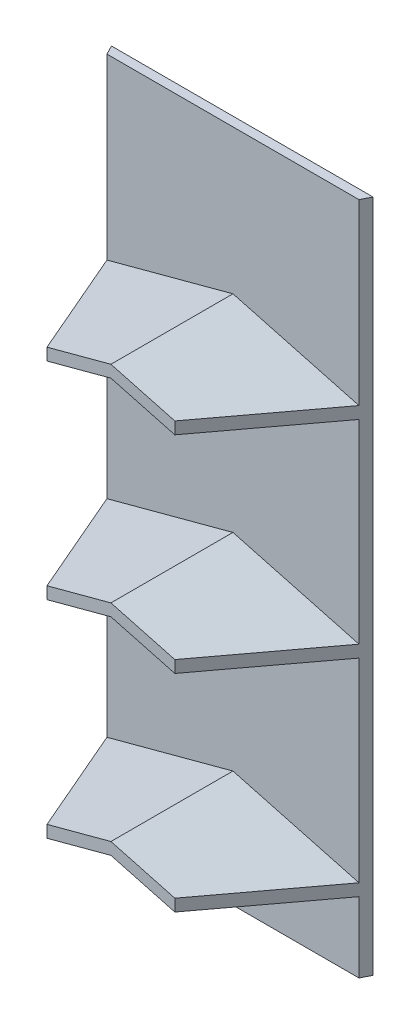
ISO-10303-21;
HEADER;
FILE_DESCRIPTION(('STEP AP214'),'2;1');
FILE_NAME('part.step','',(''),(''),'','','');
FILE_SCHEMA(('AUTOMOTIVE_DESIGN { 1 0 10303 214 1 1 1 1 }'));
ENDSEC;
DATA;
#1=APPLICATION_CONTEXT('core data for automotive mechanical design processes');
#2=APPLICATION_PROTOCOL_DEFINITION('international standard','automotive_design',2000,#1);
#3=PRODUCT_CONTEXT('',#1,'mechanical');
#4=PRODUCT('Part','Part','',(#3));
#5=PRODUCT_RELATED_PRODUCT_CATEGORY('part','',(#4));
#6=PRODUCT_DEFINITION_FORMATION('','',#4);
#7=PRODUCT_DEFINITION_CONTEXT('part definition',#1,'design');
#8=PRODUCT_DEFINITION('design','',#6,#7);
#9=PRODUCT_DEFINITION_SHAPE('','',#8);
#10=(LENGTH_UNIT() NAMED_UNIT(*) SI_UNIT(.MILLI.,.METRE.));
#11=(NAMED_UNIT(*) PLANE_ANGLE_UNIT() SI_UNIT($,.RADIAN.));
#12=(NAMED_UNIT(*) SI_UNIT($,.STERADIAN.) SOLID_ANGLE_UNIT());
#13=UNCERTAINTY_MEASURE_WITH_UNIT(LENGTH_MEASURE(1.E-05),#10,'distance_accuracy_value','');
#14=(GEOMETRIC_REPRESENTATION_CONTEXT(3) GLOBAL_UNCERTAINTY_ASSIGNED_CONTEXT((#13)) GLOBAL_UNIT_ASSIGNED_CONTEXT((#10,
#11,#12)) REPRESENTATION_CONTEXT('',''));
#15=CARTESIAN_POINT('',(0.,0.,0.));
#16=DIRECTION('',(0.,0.,1.));
#17=DIRECTION('',(1.,0.,0.));
#18=AXIS2_PLACEMENT_3D('',#15,#16,#17);
#19=CARTESIAN_POINT('',(0.00200171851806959,17.9147336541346,26.6));
#20=DIRECTION('',(0.258819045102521,0.965925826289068,0.));
#21=DIRECTION('',(-0.965925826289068,0.258819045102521,0.));
#22=AXIS2_PLACEMENT_3D('',#19,#20,#21);
#23=PLANE('',#22);
#24=DIRECTION('',(0.965925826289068,-0.258819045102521,0.));
#25=VECTOR('',#24,1.);
#26=CARTESIAN_POINT('',(0.00200171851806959,17.9147336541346,1.6));
#27=LINE('',#26,#25);
#28=CARTESIAN_POINT('',(0.00200171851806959,17.9147336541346,1.6));
#29=VERTEX_POINT('',#28);
#30=CARTESIAN_POINT('',(21.6858407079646,12.1045665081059,1.6));
#31=VERTEX_POINT('',#30);
#32=EDGE_CURVE('E271',#29,#31,#27,.T.);
#33=ORIENTED_EDGE('',*,*,#32,.T.);
#34=DIRECTION('',(-0.450200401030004,0.120630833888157,0.884741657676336));
#35=VECTOR('',#34,1.);
#36=CARTESIAN_POINT('',(7.01763645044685,16.0348999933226,30.4262101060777));
#37=LINE('',#36,#35);
#38=CARTESIAN_POINT('',(10.9999999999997,14.9678288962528,22.6));
#39=VERTEX_POINT('',#38);
#40=EDGE_CURVE('E328',#31,#39,#37,.T.);
#41=ORIENTED_EDGE('',*,*,#40,.T.);
#42=DIRECTION('',(-0.965925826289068,0.258819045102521,0.));
#43=VECTOR('',#42,1.);
#44=CARTESIAN_POINT('',(0.00200171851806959,17.9147336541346,22.6));
#45=LINE('',#44,#43);
#46=CARTESIAN_POINT('',(0.00200171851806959,17.9147336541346,22.6));
#47=VERTEX_POINT('',#46);
#48=EDGE_CURVE('E383',#39,#47,#45,.T.);
#49=ORIENTED_EDGE('',*,*,#48,.T.);
#50=DIRECTION('',(0.,0.,-1.));
#51=VECTOR('',#50,1.);
#52=CARTESIAN_POINT('',(0.00200171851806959,17.9147336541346,26.6));
#53=LINE('',#52,#51);
#54=EDGE_CURVE('E215',#47,#29,#53,.T.);
#55=ORIENTED_EDGE('',*,*,#54,.T.);
#56=EDGE_LOOP('',(#33,#41,#49,#55));
#57=FACE_BOUND('',#56,.T.);
#58=ADVANCED_FACE('F34',(#57),#23,.F.);
#59=CARTESIAN_POINT('',(0.00200171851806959,17.9147336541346,26.6));
#60=DIRECTION('',(-0.258794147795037,0.965932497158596,0.));
#61=DIRECTION('',(-0.965932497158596,-0.258794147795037,0.));
#62=AXIS2_PLACEMENT_3D('',#59,#60,#61);
#63=PLANE('',#62);
#64=DIRECTION('',(-0.965932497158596,-0.258794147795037,0.));
#65=VECTOR('',#64,1.);
#66=CARTESIAN_POINT('',(0.00200171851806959,17.9147336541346,22.6));
#67=LINE('',#66,#65);
#68=CARTESIAN_POINT('',(-11.0000000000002,14.967060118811,22.6));
#69=VERTEX_POINT('',#68);
#70=EDGE_CURVE('E386',#47,#69,#67,.T.);
#71=ORIENTED_EDGE('',*,*,#70,.T.);
#72=DIRECTION('',(-0.450201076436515,-0.1206185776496,-0.88474298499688));
#73=VECTOR('',#72,1.);
#74=CARTESIAN_POINT('',(-7.01678783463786,16.0342485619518,30.4278778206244));
#75=LINE('',#74,#73);
#76=CARTESIAN_POINT('',(-21.685840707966,12.1040929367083,1.6));
#77=VERTEX_POINT('',#76);
#78=EDGE_CURVE('E289',#69,#77,#75,.T.);
#79=ORIENTED_EDGE('',*,*,#78,.T.);
#80=DIRECTION('',(0.965932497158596,0.258794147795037,0.));
#81=VECTOR('',#80,1.);
#82=CARTESIAN_POINT('',(0.00200171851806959,17.9147336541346,1.6));
#83=LINE('',#82,#81);
#84=EDGE_CURVE('E272',#77,#29,#83,.T.);
#85=ORIENTED_EDGE('',*,*,#84,.T.);
#86=ORIENTED_EDGE('',*,*,#54,.F.);
#87=EDGE_LOOP('',(#71,#79,#85,#86));
#88=FACE_BOUND('',#87,.T.);
#89=ADVANCED_FACE('F390',(#88),#63,.F.);
#90=CARTESIAN_POINT('',(0.,0.,0.));
#91=DIRECTION('',(0.,0.,-1.));
#92=DIRECTION('',(-1.,0.,0.));
#93=AXIS2_PLACEMENT_3D('',#90,#91,#92);
#94=PLANE('',#93);
#95=DIRECTION('',(0.,-1.,0.));
#96=VECTOR('',#95,1.);
#97=CARTESIAN_POINT('',(22.5,115.985822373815,0.));
#98=LINE('',#97,#96);
#99=CARTESIAN_POINT('',(22.5,115.985822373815,0.));
#100=VERTEX_POINT('',#99);
#101=CARTESIAN_POINT('',(22.5,-0.0141776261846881,0.));
#102=VERTEX_POINT('',#101);
#103=EDGE_CURVE('E187',#100,#102,#98,.T.);
#104=ORIENTED_EDGE('',*,*,#103,.T.);
#105=DIRECTION('',(1.,0.,0.));
#106=VECTOR('',#105,1.);
#107=CARTESIAN_POINT('',(-28.575,-0.0141776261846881,0.));
#108=LINE('',#107,#106);
#109=CARTESIAN_POINT('',(-22.5000000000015,-0.0141776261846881,0.));
#110=VERTEX_POINT('',#109);
#111=EDGE_CURVE('E202',#110,#102,#108,.T.);
#112=ORIENTED_EDGE('',*,*,#111,.F.);
#113=DIRECTION('',(0.,-1.,0.));
#114=VECTOR('',#113,1.);
#115=CARTESIAN_POINT('',(-22.5000000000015,115.985822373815,0.));
#116=LINE('',#115,#114);
#117=CARTESIAN_POINT('',(-22.5000000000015,115.985822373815,0.));
#118=VERTEX_POINT('',#117);
#119=EDGE_CURVE('E206',#118,#110,#116,.T.);
#120=ORIENTED_EDGE('',*,*,#119,.F.);
#121=DIRECTION('',(-1.,0.,0.));
#122=VECTOR('',#121,1.);
#123=CARTESIAN_POINT('',(-28.575,115.985822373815,0.));
#124=LINE('',#123,#122);
#125=EDGE_CURVE('E204',#100,#118,#124,.T.);
#126=ORIENTED_EDGE('',*,*,#125,.F.);
#127=EDGE_LOOP('',(#104,#112,#120,#126));
#128=FACE_BOUND('',#127,.T.);
#129=ADVANCED_FACE('F200',(#128),#94,.T.);
#130=CARTESIAN_POINT('',(-28.575,-0.0141776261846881,1.6));
#131=DIRECTION('',(0.,1.,0.));
#132=DIRECTION('',(0.,0.,1.));
#133=AXIS2_PLACEMENT_3D('',#130,#131,#132);
#134=PLANE('',#133);
#135=ORIENTED_EDGE('',*,*,#111,.T.);
#136=DIRECTION('',(0.453512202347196,0.,-0.891250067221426));
#137=VECTOR('',#136,1.);
#138=CARTESIAN_POINT('',(22.5,-0.0141776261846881,0.));
#139=LINE('',#138,#137);
#140=CARTESIAN_POINT('',(21.6858407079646,-0.0141776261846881,1.6));
#141=VERTEX_POINT('',#140);
#142=EDGE_CURVE('E184',#141,#102,#139,.T.);
#143=ORIENTED_EDGE('',*,*,#142,.F.);
#144=DIRECTION('',(1.,0.,0.));
#145=VECTOR('',#144,1.);
#146=CARTESIAN_POINT('',(-28.575,-0.0141776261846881,1.6));
#147=LINE('',#146,#145);
#148=CARTESIAN_POINT('',(-21.685840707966,-0.0141776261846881,1.6));
#149=VERTEX_POINT('',#148);
#150=EDGE_CURVE('E213',#149,#141,#147,.T.);
#151=ORIENTED_EDGE('',*,*,#150,.F.);
#152=DIRECTION('',(0.453512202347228,0.,0.89125006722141));
#153=VECTOR('',#152,1.);
#154=CARTESIAN_POINT('',(-22.5000000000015,-0.0141776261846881,0.));
#155=LINE('',#154,#153);
#156=EDGE_CURVE('E195',#110,#149,#155,.T.);
#157=ORIENTED_EDGE('',*,*,#156,.F.);
#158=EDGE_LOOP('',(#135,#143,#151,#157));
#159=FACE_BOUND('',#158,.T.);
#160=ADVANCED_FACE('F209',(#159),#134,.F.);
#161=CARTESIAN_POINT('',(-28.575,115.985822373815,1.6));
#162=DIRECTION('',(0.,-1.,0.));
#163=DIRECTION('',(0.,0.,-1.));
#164=AXIS2_PLACEMENT_3D('',#161,#162,#163);
#165=PLANE('',#164);
#166=DIRECTION('',(-1.,0.,0.));
#167=VECTOR('',#166,1.);
#168=CARTESIAN_POINT('',(-28.575,115.985822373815,1.6));
#169=LINE('',#168,#167);
#170=CARTESIAN_POINT('',(21.6858407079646,115.985822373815,1.6));
#171=VERTEX_POINT('',#170);
#172=CARTESIAN_POINT('',(-21.685840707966,115.985822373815,1.6));
#173=VERTEX_POINT('',#172);
#174=EDGE_CURVE('E210',#171,#173,#169,.T.);
#175=ORIENTED_EDGE('',*,*,#174,.F.);
#176=DIRECTION('',(0.453512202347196,0.,-0.891250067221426));
#177=VECTOR('',#176,1.);
#178=CARTESIAN_POINT('',(22.5,115.985822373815,0.));
#179=LINE('',#178,#177);
#180=EDGE_CURVE('E402',#171,#100,#179,.T.);
#181=ORIENTED_EDGE('',*,*,#180,.T.);
#182=ORIENTED_EDGE('',*,*,#125,.T.);
#183=DIRECTION('',(0.453512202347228,0.,0.89125006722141));
#184=VECTOR('',#183,1.);
#185=CARTESIAN_POINT('',(-22.5000000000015,115.985822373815,0.));
#186=LINE('',#185,#184);
#187=EDGE_CURVE('E398',#118,#173,#186,.T.);
#188=ORIENTED_EDGE('',*,*,#187,.T.);
#189=EDGE_LOOP('',(#175,#181,#182,#188));
#190=FACE_BOUND('',#189,.T.);
#191=ADVANCED_FACE('F36',(#190),#165,.F.);
#192=CARTESIAN_POINT('',(0.,0.,1.6));
#193=DIRECTION('',(0.,0.,-1.));
#194=DIRECTION('',(-1.,0.,0.));
#195=AXIS2_PLACEMENT_3D('',#192,#193,#194);
#196=PLANE('',#195);
#197=ORIENTED_EDGE('',*,*,#150,.T.);
#198=DIRECTION('',(0.,1.,0.));
#199=VECTOR('',#198,1.);
#200=CARTESIAN_POINT('',(21.6858407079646,0.,1.6));
#201=LINE('',#200,#199);
#202=EDGE_CURVE('E190',#141,#31,#201,.T.);
#203=ORIENTED_EDGE('',*,*,#202,.T.);
#204=ORIENTED_EDGE('',*,*,#32,.F.);
#205=ORIENTED_EDGE('',*,*,#84,.F.);
#206=DIRECTION('',(0.,-1.,0.));
#207=VECTOR('',#206,1.);
#208=CARTESIAN_POINT('',(-21.685840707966,0.,1.6));
#209=LINE('',#208,#207);
#210=EDGE_CURVE('E286',#77,#149,#209,.T.);
#211=ORIENTED_EDGE('',*,*,#210,.T.);
#212=EDGE_LOOP('',(#197,#203,#204,#205,#211));
#213=FACE_BOUND('',#212,.T.);
#214=ADVANCED_FACE('F283',(#213),#196,.F.);
#215=CARTESIAN_POINT('',(-7.59873433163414E-13,91.1058223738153,26.6));
#216=DIRECTION('',(-0.258819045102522,-0.965925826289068,0.));
#217=DIRECTION('',(0.965925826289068,-0.258819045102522,0.));
#218=AXIS2_PLACEMENT_3D('',#215,#216,#217);
#219=PLANE('',#218);
#220=DIRECTION('',(0.965925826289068,-0.258819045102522,0.));
#221=VECTOR('',#220,1.);
#222=CARTESIAN_POINT('',(-7.59873433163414E-13,91.1058223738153,22.6));
#223=LINE('',#222,#221);
#224=CARTESIAN_POINT('',(-7.59873433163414E-13,91.1058223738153,22.6));
#225=VERTEX_POINT('',#224);
#226=CARTESIAN_POINT('',(10.9999999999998,88.1583812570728,22.6));
#227=VERTEX_POINT('',#226);
#228=EDGE_CURVE('E219',#225,#227,#223,.T.);
#229=ORIENTED_EDGE('',*,*,#228,.T.);
#230=DIRECTION('',(0.450200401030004,-0.120630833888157,-0.884741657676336));
#231=VECTOR('',#230,1.);
#232=CARTESIAN_POINT('',(7.01720161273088,89.2255688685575,30.4270646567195));
#233=LINE('',#232,#231);
#234=CARTESIAN_POINT('',(21.6858407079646,85.295118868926,1.6));
#235=VERTEX_POINT('',#234);
#236=EDGE_CURVE('E42',#227,#235,#233,.T.);
#237=ORIENTED_EDGE('',*,*,#236,.T.);
#238=DIRECTION('',(-0.965925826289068,0.258819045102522,0.));
#239=VECTOR('',#238,1.);
#240=CARTESIAN_POINT('',(-7.59873433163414E-13,91.1058223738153,1.6));
#241=LINE('',#240,#239);
#242=CARTESIAN_POINT('',(-7.63278329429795E-13,91.1058223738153,1.6));
#243=VERTEX_POINT('',#242);
#244=EDGE_CURVE('E229',#235,#243,#241,.T.);
#245=ORIENTED_EDGE('',*,*,#244,.T.);
#246=DIRECTION('',(0.,0.,-1.));
#247=VECTOR('',#246,1.);
#248=CARTESIAN_POINT('',(-7.59873433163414E-13,91.1058223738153,26.6));
#249=LINE('',#248,#247);
#250=EDGE_CURVE('E240',#225,#243,#249,.T.);
#251=ORIENTED_EDGE('',*,*,#250,.F.);
#252=EDGE_LOOP('',(#229,#237,#245,#251));
#253=FACE_BOUND('',#252,.T.);
#254=ADVANCED_FACE('F227',(#253),#219,.F.);
#255=CARTESIAN_POINT('',(-7.59873433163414E-13,91.1058223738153,26.6));
#256=DIRECTION('',(0.258819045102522,-0.965925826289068,0.));
#257=DIRECTION('',(0.965925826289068,0.258819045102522,0.));
#258=AXIS2_PLACEMENT_3D('',#255,#256,#257);
#259=PLANE('',#258);
#260=DIRECTION('',(-0.965925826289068,-0.258819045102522,0.));
#261=VECTOR('',#260,1.);
#262=CARTESIAN_POINT('',(-7.59873433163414E-13,91.1058223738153,1.6));
#263=LINE('',#262,#261);
#264=CARTESIAN_POINT('',(-21.685840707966,85.295118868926,1.6));
#265=VERTEX_POINT('',#264);
#266=EDGE_CURVE('E239',#243,#265,#263,.T.);
#267=ORIENTED_EDGE('',*,*,#266,.T.);
#268=DIRECTION('',(0.450200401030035,0.120630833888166,0.884741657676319));
#269=VECTOR('',#268,1.);
#270=CARTESIAN_POINT('',(-7.01720161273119,89.2255688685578,30.4270646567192));
#271=LINE('',#270,#269);
#272=CARTESIAN_POINT('',(-11.0000000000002,88.1583812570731,22.6));
#273=VERTEX_POINT('',#272);
#274=EDGE_CURVE('E337',#265,#273,#271,.T.);
#275=ORIENTED_EDGE('',*,*,#274,.T.);
#276=DIRECTION('',(0.965925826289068,0.258819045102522,0.));
#277=VECTOR('',#276,1.);
#278=CARTESIAN_POINT('',(-7.59873433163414E-13,91.1058223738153,22.6));
#279=LINE('',#278,#277);
#280=EDGE_CURVE('E205',#273,#225,#279,.T.);
#281=ORIENTED_EDGE('',*,*,#280,.T.);
#282=ORIENTED_EDGE('',*,*,#250,.T.);
#283=EDGE_LOOP('',(#267,#275,#281,#282));
#284=FACE_BOUND('',#283,.T.);
#285=ADVANCED_FACE('F422',(#284),#259,.F.);
#286=ORIENTED_EDGE('',*,*,#244,.F.);
#287=DIRECTION('',(0.,1.,0.));
#288=VECTOR('',#287,1.);
#289=CARTESIAN_POINT('',(21.6858407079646,0.,1.6));
#290=LINE('',#289,#288);
#291=EDGE_CURVE('E235',#235,#171,#290,.T.);
#292=ORIENTED_EDGE('',*,*,#291,.T.);
#293=ORIENTED_EDGE('',*,*,#174,.T.);
#294=DIRECTION('',(0.,-1.,0.));
#295=VECTOR('',#294,1.);
#296=CARTESIAN_POINT('',(-21.685840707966,0.,1.6));
#297=LINE('',#296,#295);
#298=EDGE_CURVE('E340',#173,#265,#297,.T.);
#299=ORIENTED_EDGE('',*,*,#298,.T.);
#300=ORIENTED_EDGE('',*,*,#266,.F.);
#301=EDGE_LOOP('',(#286,#292,#293,#299,#300));
#302=FACE_BOUND('',#301,.T.);
#303=ADVANCED_FACE('F234',(#302),#196,.F.);
#304=CARTESIAN_POINT('',(-22.5000000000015,115.985822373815,0.));
#305=DIRECTION('',(0.89125006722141,0.,-0.453512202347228));
#306=DIRECTION('',(-0.453512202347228,0.,-0.89125006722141));
#307=AXIS2_PLACEMENT_3D('',#304,#305,#306);
#308=PLANE('',#307);
#309=ORIENTED_EDGE('',*,*,#78,.F.);
#310=DIRECTION('',(0.,-1.,0.));
#311=VECTOR('',#310,1.);
#312=CARTESIAN_POINT('',(-11.0000000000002,115.985822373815,22.6));
#313=LINE('',#312,#311);
#314=CARTESIAN_POINT('',(-11.0000000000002,17.0383812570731,22.6));
#315=VERTEX_POINT('',#314);
#316=EDGE_CURVE('E357',#315,#69,#313,.T.);
#317=ORIENTED_EDGE('',*,*,#316,.F.);
#318=DIRECTION('',(0.450200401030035,0.120630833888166,0.884741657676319));
#319=VECTOR('',#318,1.);
#320=CARTESIAN_POINT('',(-7.01720161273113,18.1055688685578,30.4270646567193));
#321=LINE('',#320,#319);
#322=CARTESIAN_POINT('',(-21.685840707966,14.175118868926,1.6));
#323=VERTEX_POINT('',#322);
#324=EDGE_CURVE('E292',#323,#315,#321,.T.);
#325=ORIENTED_EDGE('',*,*,#324,.F.);
#326=DIRECTION('',(0.,-1.,0.));
#327=VECTOR('',#326,1.);
#328=CARTESIAN_POINT('',(-21.685840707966,0.,1.6));
#329=LINE('',#328,#327);
#330=CARTESIAN_POINT('',(-21.685840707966,47.6640929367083,1.6));
#331=VERTEX_POINT('',#330);
#332=EDGE_CURVE('E345',#331,#323,#329,.T.);
#333=ORIENTED_EDGE('',*,*,#332,.F.);
#334=DIRECTION('',(-0.450201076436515,-0.1206185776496,-0.88474298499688));
#335=VECTOR('',#334,1.);
#336=CARTESIAN_POINT('',(-7.01678783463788,51.5942485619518,30.4278778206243));
#337=LINE('',#336,#335);
#338=CARTESIAN_POINT('',(-11.0000000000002,50.527060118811,22.6));
#339=VERTEX_POINT('',#338);
#340=EDGE_CURVE('E342',#339,#331,#337,.T.);
#341=ORIENTED_EDGE('',*,*,#340,.F.);
#342=CARTESIAN_POINT('',(-11.0000000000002,52.5983812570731,22.6));
#343=VERTEX_POINT('',#342);
#344=EDGE_CURVE('E405',#343,#339,#313,.T.);
#345=ORIENTED_EDGE('',*,*,#344,.F.);
#346=DIRECTION('',(0.450200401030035,0.120630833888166,0.884741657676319));
#347=VECTOR('',#346,1.);
#348=CARTESIAN_POINT('',(-7.01720161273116,53.6655688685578,30.4270646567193));
#349=LINE('',#348,#347);
#350=CARTESIAN_POINT('',(-21.685840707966,49.735118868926,1.6));
#351=VERTEX_POINT('',#350);
#352=EDGE_CURVE('E334',#351,#343,#349,.T.);
#353=ORIENTED_EDGE('',*,*,#352,.F.);
#354=DIRECTION('',(0.,-1.,0.));
#355=VECTOR('',#354,1.);
#356=CARTESIAN_POINT('',(-21.685840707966,0.,1.6));
#357=LINE('',#356,#355);
#358=CARTESIAN_POINT('',(-21.685840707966,83.2240929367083,1.6));
#359=VERTEX_POINT('',#358);
#360=EDGE_CURVE('E332',#359,#351,#357,.T.);
#361=ORIENTED_EDGE('',*,*,#360,.F.);
#362=DIRECTION('',(-0.450201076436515,-0.1206185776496,-0.88474298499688));
#363=VECTOR('',#362,1.);
#364=CARTESIAN_POINT('',(-7.01678783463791,87.1542485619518,30.4278778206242));
#365=LINE('',#364,#363);
#366=CARTESIAN_POINT('',(-11.0000000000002,86.087060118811,22.6));
#367=VERTEX_POINT('',#366);
#368=EDGE_CURVE('E12',#367,#359,#365,.T.);
#369=ORIENTED_EDGE('',*,*,#368,.F.);
#370=EDGE_CURVE('E406',#273,#367,#313,.T.);
#371=ORIENTED_EDGE('',*,*,#370,.F.);
#372=ORIENTED_EDGE('',*,*,#274,.F.);
#373=ORIENTED_EDGE('',*,*,#298,.F.);
#374=ORIENTED_EDGE('',*,*,#187,.F.);
#375=ORIENTED_EDGE('',*,*,#119,.T.);
#376=ORIENTED_EDGE('',*,*,#156,.T.);
#377=ORIENTED_EDGE('',*,*,#210,.F.);
#378=EDGE_LOOP('',(#309,#317,#325,#333,#341,#345,#353,#361,#369,#371,#372,#373,#374,#375,#376,#377));
#379=FACE_BOUND('',#378,.T.);
#380=ADVANCED_FACE('F355',(#379),#308,.F.);
#381=CARTESIAN_POINT('',(22.5,115.985822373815,0.));
#382=DIRECTION('',(-0.891250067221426,0.,-0.453512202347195));
#383=DIRECTION('',(-0.453512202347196,0.,0.891250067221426));
#384=AXIS2_PLACEMENT_3D('',#381,#382,#383);
#385=PLANE('',#384);
#386=ORIENTED_EDGE('',*,*,#142,.T.);
#387=ORIENTED_EDGE('',*,*,#103,.F.);
#388=ORIENTED_EDGE('',*,*,#180,.F.);
#389=ORIENTED_EDGE('',*,*,#291,.F.);
#390=ORIENTED_EDGE('',*,*,#236,.F.);
#391=DIRECTION('',(0.,-1.,0.));
#392=VECTOR('',#391,1.);
#393=CARTESIAN_POINT('',(10.9999999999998,115.985822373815,22.6));
#394=LINE('',#393,#392);
#395=CARTESIAN_POINT('',(10.9999999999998,86.0878288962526,22.6));
#396=VERTEX_POINT('',#395);
#397=EDGE_CURVE('E400',#227,#396,#394,.T.);
#398=ORIENTED_EDGE('',*,*,#397,.T.);
#399=DIRECTION('',(-0.450200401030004,0.120630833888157,0.884741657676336));
#400=VECTOR('',#399,1.);
#401=CARTESIAN_POINT('',(7.01763645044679,87.1548999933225,30.4262101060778));
#402=LINE('',#401,#400);
#403=CARTESIAN_POINT('',(21.6858407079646,83.2245665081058,1.6));
#404=VERTEX_POINT('',#403);
#405=EDGE_CURVE('E313',#404,#396,#402,.T.);
#406=ORIENTED_EDGE('',*,*,#405,.F.);
#407=DIRECTION('',(0.,1.,0.));
#408=VECTOR('',#407,1.);
#409=CARTESIAN_POINT('',(21.6858407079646,0.,1.6));
#410=LINE('',#409,#408);
#411=CARTESIAN_POINT('',(21.6858407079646,49.735118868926,1.6));
#412=VERTEX_POINT('',#411);
#413=EDGE_CURVE('E309',#412,#404,#410,.T.);
#414=ORIENTED_EDGE('',*,*,#413,.F.);
#415=DIRECTION('',(0.450200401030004,-0.120630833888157,-0.884741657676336));
#416=VECTOR('',#415,1.);
#417=CARTESIAN_POINT('',(7.01720161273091,53.6655688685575,30.4270646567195));
#418=LINE('',#417,#416);
#419=CARTESIAN_POINT('',(10.9999999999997,52.5983812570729,22.6));
#420=VERTEX_POINT('',#419);
#421=EDGE_CURVE('E312',#420,#412,#418,.T.);
#422=ORIENTED_EDGE('',*,*,#421,.F.);
#423=CARTESIAN_POINT('',(10.9999999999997,50.5278288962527,22.6));
#424=VERTEX_POINT('',#423);
#425=EDGE_CURVE('E397',#420,#424,#394,.T.);
#426=ORIENTED_EDGE('',*,*,#425,.T.);
#427=DIRECTION('',(-0.450200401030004,0.120630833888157,0.884741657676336));
#428=VECTOR('',#427,1.);
#429=CARTESIAN_POINT('',(7.01763645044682,51.5948999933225,30.4262101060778));
#430=LINE('',#429,#428);
#431=CARTESIAN_POINT('',(21.6858407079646,47.6645665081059,1.6));
#432=VERTEX_POINT('',#431);
#433=EDGE_CURVE('E315',#432,#424,#430,.T.);
#434=ORIENTED_EDGE('',*,*,#433,.F.);
#435=DIRECTION('',(0.,1.,0.));
#436=VECTOR('',#435,1.);
#437=CARTESIAN_POINT('',(21.6858407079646,0.,1.6));
#438=LINE('',#437,#436);
#439=CARTESIAN_POINT('',(21.6858407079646,14.1751188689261,1.6));
#440=VERTEX_POINT('',#439);
#441=EDGE_CURVE('E322',#440,#432,#438,.T.);
#442=ORIENTED_EDGE('',*,*,#441,.F.);
#443=DIRECTION('',(0.450200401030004,-0.120630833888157,-0.884741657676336));
#444=VECTOR('',#443,1.);
#445=CARTESIAN_POINT('',(7.01720161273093,18.1055688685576,30.4270646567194));
#446=LINE('',#445,#444);
#447=CARTESIAN_POINT('',(10.9999999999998,17.0383812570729,22.6));
#448=VERTEX_POINT('',#447);
#449=EDGE_CURVE('E325',#448,#440,#446,.T.);
#450=ORIENTED_EDGE('',*,*,#449,.F.);
#451=EDGE_CURVE('E396',#448,#39,#394,.T.);
#452=ORIENTED_EDGE('',*,*,#451,.T.);
#453=ORIENTED_EDGE('',*,*,#40,.F.);
#454=ORIENTED_EDGE('',*,*,#202,.F.);
#455=EDGE_LOOP('',(#386,#387,#388,#389,#390,#398,#406,#414,#422,#426,#434,#442,#450,#452,#453,#454));
#456=FACE_BOUND('',#455,.T.);
#457=ADVANCED_FACE('F186',(#456),#385,.F.);
#458=CARTESIAN_POINT('',(-11.0000000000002,115.985822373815,22.6));
#459=DIRECTION('',(0.,0.,-1.));
#460=DIRECTION('',(-1.,0.,0.));
#461=AXIS2_PLACEMENT_3D('',#458,#459,#460);
#462=PLANE('',#461);
#463=ORIENTED_EDGE('',*,*,#48,.F.);
#464=ORIENTED_EDGE('',*,*,#451,.F.);
#465=DIRECTION('',(0.965925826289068,-0.258819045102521,0.));
#466=VECTOR('',#465,1.);
#467=CARTESIAN_POINT('',(-5.11559280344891E-13,19.9858223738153,22.6));
#468=LINE('',#467,#466);
#469=CARTESIAN_POINT('',(-5.11559280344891E-13,19.9858223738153,22.6));
#470=VERTEX_POINT('',#469);
#471=EDGE_CURVE('E373',#470,#448,#468,.T.);
#472=ORIENTED_EDGE('',*,*,#471,.F.);
#473=DIRECTION('',(0.965925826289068,0.258819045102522,0.));
#474=VECTOR('',#473,1.);
#475=CARTESIAN_POINT('',(-5.11559280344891E-13,19.9858223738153,22.6));
#476=LINE('',#475,#474);
#477=EDGE_CURVE('E351',#315,#470,#476,.T.);
#478=ORIENTED_EDGE('',*,*,#477,.F.);
#479=ORIENTED_EDGE('',*,*,#316,.T.);
#480=ORIENTED_EDGE('',*,*,#70,.F.);
#481=EDGE_LOOP('',(#463,#464,#472,#478,#479,#480));
#482=FACE_BOUND('',#481,.T.);
#483=ADVANCED_FACE('F392',(#482),#462,.F.);
#484=DIRECTION('',(-0.965925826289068,0.258819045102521,0.));
#485=VECTOR('',#484,1.);
#486=CARTESIAN_POINT('',(0.00200171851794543,53.4747336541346,22.6));
#487=LINE('',#486,#485);
#488=CARTESIAN_POINT('',(0.00200171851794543,53.4747336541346,22.6));
#489=VERTEX_POINT('',#488);
#490=EDGE_CURVE('E368',#424,#489,#487,.T.);
#491=ORIENTED_EDGE('',*,*,#490,.F.);
#492=ORIENTED_EDGE('',*,*,#425,.F.);
#493=DIRECTION('',(0.965925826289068,-0.258819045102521,0.));
#494=VECTOR('',#493,1.);
#495=CARTESIAN_POINT('',(-6.35716356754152E-13,55.5458223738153,22.6));
#496=LINE('',#495,#494);
#497=CARTESIAN_POINT('',(-6.35716356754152E-13,55.5458223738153,22.6));
#498=VERTEX_POINT('',#497);
#499=EDGE_CURVE('E376',#498,#420,#496,.T.);
#500=ORIENTED_EDGE('',*,*,#499,.F.);
#501=DIRECTION('',(0.965925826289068,0.258819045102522,0.));
#502=VECTOR('',#501,1.);
#503=CARTESIAN_POINT('',(-6.35716356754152E-13,55.5458223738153,22.6));
#504=LINE('',#503,#502);
#505=EDGE_CURVE('E371',#343,#498,#504,.T.);
#506=ORIENTED_EDGE('',*,*,#505,.F.);
#507=ORIENTED_EDGE('',*,*,#344,.T.);
#508=DIRECTION('',(-0.965932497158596,-0.258794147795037,0.));
#509=VECTOR('',#508,1.);
#510=CARTESIAN_POINT('',(0.00200171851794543,53.4747336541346,22.6));
#511=LINE('',#510,#509);
#512=EDGE_CURVE('E49',#489,#339,#511,.T.);
#513=ORIENTED_EDGE('',*,*,#512,.F.);
#514=EDGE_LOOP('',(#491,#492,#500,#506,#507,#513));
#515=FACE_BOUND('',#514,.T.);
#516=ADVANCED_FACE('F417',(#515),#462,.F.);
#517=DIRECTION('',(-0.965925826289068,0.258819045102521,0.));
#518=VECTOR('',#517,1.);
#519=CARTESIAN_POINT('',(0.00200171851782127,89.0347336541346,22.6));
#520=LINE('',#519,#518);
#521=CARTESIAN_POINT('',(0.00200171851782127,89.0347336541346,22.6));
#522=VERTEX_POINT('',#521);
#523=EDGE_CURVE('E305',#396,#522,#520,.T.);
#524=ORIENTED_EDGE('',*,*,#523,.F.);
#525=ORIENTED_EDGE('',*,*,#397,.F.);
#526=ORIENTED_EDGE('',*,*,#228,.F.);
#527=ORIENTED_EDGE('',*,*,#280,.F.);
#528=ORIENTED_EDGE('',*,*,#370,.T.);
#529=DIRECTION('',(-0.965932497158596,-0.258794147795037,0.));
#530=VECTOR('',#529,1.);
#531=CARTESIAN_POINT('',(0.00200171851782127,89.0347336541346,22.6));
#532=LINE('',#531,#530);
#533=EDGE_CURVE('E57',#522,#367,#532,.T.);
#534=ORIENTED_EDGE('',*,*,#533,.F.);
#535=EDGE_LOOP('',(#524,#525,#526,#527,#528,#534));
#536=FACE_BOUND('',#535,.T.);
#537=ADVANCED_FACE('F423',(#536),#462,.F.);
#538=CARTESIAN_POINT('',(0.00200171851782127,89.0347336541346,26.6));
#539=DIRECTION('',(0.258819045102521,0.965925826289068,0.));
#540=DIRECTION('',(-0.965925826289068,0.258819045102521,0.));
#541=AXIS2_PLACEMENT_3D('',#538,#539,#540);
#542=PLANE('',#541);
#543=DIRECTION('',(0.965925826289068,-0.258819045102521,0.));
#544=VECTOR('',#543,1.);
#545=CARTESIAN_POINT('',(0.00200171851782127,89.0347336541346,1.6));
#546=LINE('',#545,#544);
#547=CARTESIAN_POINT('',(0.00200171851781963,89.0347336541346,1.6));
#548=VERTEX_POINT('',#547);
#549=EDGE_CURVE('E241',#548,#404,#546,.T.);
#550=ORIENTED_EDGE('',*,*,#549,.T.);
#551=ORIENTED_EDGE('',*,*,#405,.T.);
#552=ORIENTED_EDGE('',*,*,#523,.T.);
#553=DIRECTION('',(0.,0.,-1.));
#554=VECTOR('',#553,1.);
#555=CARTESIAN_POINT('',(0.00200171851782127,89.0347336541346,26.6));
#556=LINE('',#555,#554);
#557=EDGE_CURVE('E243',#522,#548,#556,.T.);
#558=ORIENTED_EDGE('',*,*,#557,.T.);
#559=EDGE_LOOP('',(#550,#551,#552,#558));
#560=FACE_BOUND('',#559,.T.);
#561=ADVANCED_FACE('F303',(#560),#542,.F.);
#562=CARTESIAN_POINT('',(0.00200171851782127,89.0347336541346,26.6));
#563=DIRECTION('',(-0.258794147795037,0.965932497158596,0.));
#564=DIRECTION('',(-0.965932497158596,-0.258794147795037,0.));
#565=AXIS2_PLACEMENT_3D('',#562,#563,#564);
#566=PLANE('',#565);
#567=ORIENTED_EDGE('',*,*,#533,.T.);
#568=ORIENTED_EDGE('',*,*,#368,.T.);
#569=DIRECTION('',(0.965932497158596,0.258794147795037,0.));
#570=VECTOR('',#569,1.);
#571=CARTESIAN_POINT('',(0.00200171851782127,89.0347336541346,1.6));
#572=LINE('',#571,#570);
#573=EDGE_CURVE('E246',#359,#548,#572,.T.);
#574=ORIENTED_EDGE('',*,*,#573,.T.);
#575=ORIENTED_EDGE('',*,*,#557,.F.);
#576=EDGE_LOOP('',(#567,#568,#574,#575));
#577=FACE_BOUND('',#576,.T.);
#578=ADVANCED_FACE('F298',(#577),#566,.F.);
#579=CARTESIAN_POINT('',(-6.35716356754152E-13,55.5458223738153,26.6));
#580=DIRECTION('',(-0.258819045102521,-0.965925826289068,0.));
#581=DIRECTION('',(0.965925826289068,-0.258819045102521,0.));
#582=AXIS2_PLACEMENT_3D('',#579,#580,#581);
#583=PLANE('',#582);
#584=ORIENTED_EDGE('',*,*,#499,.T.);
#585=ORIENTED_EDGE('',*,*,#421,.T.);
#586=DIRECTION('',(-0.965925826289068,0.258819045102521,0.));
#587=VECTOR('',#586,1.);
#588=CARTESIAN_POINT('',(-6.35716356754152E-13,55.5458223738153,1.6));
#589=LINE('',#588,#587);
#590=CARTESIAN_POINT('',(-6.36643515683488E-13,55.5458223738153,1.6));
#591=VERTEX_POINT('',#590);
#592=EDGE_CURVE('E260',#412,#591,#589,.T.);
#593=ORIENTED_EDGE('',*,*,#592,.T.);
#594=DIRECTION('',(0.,0.,-1.));
#595=VECTOR('',#594,1.);
#596=CARTESIAN_POINT('',(-6.35716356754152E-13,55.5458223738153,26.6));
#597=LINE('',#596,#595);
#598=EDGE_CURVE('E263',#498,#591,#597,.T.);
#599=ORIENTED_EDGE('',*,*,#598,.F.);
#600=EDGE_LOOP('',(#584,#585,#593,#599));
#601=FACE_BOUND('',#600,.T.);
#602=ADVANCED_FACE('F416',(#601),#583,.F.);
#603=CARTESIAN_POINT('',(-6.35716356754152E-13,55.5458223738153,26.6));
#604=DIRECTION('',(0.258819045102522,-0.965925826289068,0.));
#605=DIRECTION('',(0.965925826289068,0.258819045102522,0.));
#606=AXIS2_PLACEMENT_3D('',#603,#604,#605);
#607=PLANE('',#606);
#608=DIRECTION('',(-0.965925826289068,-0.258819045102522,0.));
#609=VECTOR('',#608,1.);
#610=CARTESIAN_POINT('',(-6.35716356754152E-13,55.5458223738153,1.6));
#611=LINE('',#610,#609);
#612=EDGE_CURVE('E252',#591,#351,#611,.T.);
#613=ORIENTED_EDGE('',*,*,#612,.T.);
#614=ORIENTED_EDGE('',*,*,#352,.T.);
#615=ORIENTED_EDGE('',*,*,#505,.T.);
#616=ORIENTED_EDGE('',*,*,#598,.T.);
#617=EDGE_LOOP('',(#613,#614,#615,#616));
#618=FACE_BOUND('',#617,.T.);
#619=ADVANCED_FACE('F420',(#618),#607,.F.);
#620=ORIENTED_EDGE('',*,*,#592,.F.);
#621=ORIENTED_EDGE('',*,*,#413,.T.);
#622=ORIENTED_EDGE('',*,*,#549,.F.);
#623=ORIENTED_EDGE('',*,*,#573,.F.);
#624=ORIENTED_EDGE('',*,*,#360,.T.);
#625=ORIENTED_EDGE('',*,*,#612,.F.);
#626=EDGE_LOOP('',(#620,#621,#622,#623,#624,#625));
#627=FACE_BOUND('',#626,.T.);
#628=ADVANCED_FACE('F308',(#627),#196,.F.);
#629=DIRECTION('',(-0.965925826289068,0.258819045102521,0.));
#630=VECTOR('',#629,1.);
#631=CARTESIAN_POINT('',(-5.11559280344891E-13,19.9858223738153,1.6));
#632=LINE('',#631,#630);
#633=CARTESIAN_POINT('',(-5.11559280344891E-13,19.9858223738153,1.6));
#634=VERTEX_POINT('',#633);
#635=EDGE_CURVE('E221',#440,#634,#632,.T.);
#636=ORIENTED_EDGE('',*,*,#635,.F.);
#637=ORIENTED_EDGE('',*,*,#441,.T.);
#638=DIRECTION('',(0.965925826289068,-0.258819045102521,0.));
#639=VECTOR('',#638,1.);
#640=CARTESIAN_POINT('',(0.00200171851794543,53.4747336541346,1.6));
#641=LINE('',#640,#639);
#642=CARTESIAN_POINT('',(0.00200171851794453,53.4747336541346,1.6));
#643=VERTEX_POINT('',#642);
#644=EDGE_CURVE('E257',#643,#432,#641,.T.);
#645=ORIENTED_EDGE('',*,*,#644,.F.);
#646=DIRECTION('',(0.965932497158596,0.258794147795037,0.));
#647=VECTOR('',#646,1.);
#648=CARTESIAN_POINT('',(0.00200171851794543,53.4747336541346,1.6));
#649=LINE('',#648,#647);
#650=EDGE_CURVE('E255',#331,#643,#649,.T.);
#651=ORIENTED_EDGE('',*,*,#650,.F.);
#652=ORIENTED_EDGE('',*,*,#332,.T.);
#653=DIRECTION('',(-0.965925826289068,-0.258819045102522,0.));
#654=VECTOR('',#653,1.);
#655=CARTESIAN_POINT('',(-5.11559280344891E-13,19.9858223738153,1.6));
#656=LINE('',#655,#654);
#657=EDGE_CURVE('E268',#634,#323,#656,.T.);
#658=ORIENTED_EDGE('',*,*,#657,.F.);
#659=EDGE_LOOP('',(#636,#637,#645,#651,#652,#658));
#660=FACE_BOUND('',#659,.T.);
#661=ADVANCED_FACE('F361',(#660),#196,.F.);
#662=CARTESIAN_POINT('',(-5.11559280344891E-13,19.9858223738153,26.6));
#663=DIRECTION('',(0.258819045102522,-0.965925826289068,0.));
#664=DIRECTION('',(0.965925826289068,0.258819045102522,0.));
#665=AXIS2_PLACEMENT_3D('',#662,#663,#664);
#666=PLANE('',#665);
#667=ORIENTED_EDGE('',*,*,#657,.T.);
#668=ORIENTED_EDGE('',*,*,#324,.T.);
#669=ORIENTED_EDGE('',*,*,#477,.T.);
#670=DIRECTION('',(0.,0.,-1.));
#671=VECTOR('',#670,1.);
#672=CARTESIAN_POINT('',(-5.11559280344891E-13,19.9858223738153,26.6));
#673=LINE('',#672,#671);
#674=EDGE_CURVE('E276',#470,#634,#673,.T.);
#675=ORIENTED_EDGE('',*,*,#674,.T.);
#676=EDGE_LOOP('',(#667,#668,#669,#675));
#677=FACE_BOUND('',#676,.T.);
#678=ADVANCED_FACE('F350',(#677),#666,.F.);
#679=CARTESIAN_POINT('',(-5.11559280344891E-13,19.9858223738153,26.6));
#680=DIRECTION('',(-0.258819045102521,-0.965925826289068,0.));
#681=DIRECTION('',(0.965925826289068,-0.258819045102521,0.));
#682=AXIS2_PLACEMENT_3D('',#679,#680,#681);
#683=PLANE('',#682);
#684=ORIENTED_EDGE('',*,*,#471,.T.);
#685=ORIENTED_EDGE('',*,*,#449,.T.);
#686=ORIENTED_EDGE('',*,*,#635,.T.);
#687=ORIENTED_EDGE('',*,*,#674,.F.);
#688=EDGE_LOOP('',(#684,#685,#686,#687));
#689=FACE_BOUND('',#688,.T.);
#690=ADVANCED_FACE('F440',(#689),#683,.F.);
#691=CARTESIAN_POINT('',(0.00200171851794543,53.4747336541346,26.6));
#692=DIRECTION('',(-0.258794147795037,0.965932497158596,0.));
#693=DIRECTION('',(-0.965932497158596,-0.258794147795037,0.));
#694=AXIS2_PLACEMENT_3D('',#691,#692,#693);
#695=PLANE('',#694);
#696=ORIENTED_EDGE('',*,*,#512,.T.);
#697=ORIENTED_EDGE('',*,*,#340,.T.);
#698=ORIENTED_EDGE('',*,*,#650,.T.);
#699=DIRECTION('',(0.,0.,-1.));
#700=VECTOR('',#699,1.);
#701=CARTESIAN_POINT('',(0.00200171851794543,53.4747336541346,26.6));
#702=LINE('',#701,#700);
#703=EDGE_CURVE('E265',#489,#643,#702,.T.);
#704=ORIENTED_EDGE('',*,*,#703,.F.);
#705=EDGE_LOOP('',(#696,#697,#698,#704));
#706=FACE_BOUND('',#705,.T.);
#707=ADVANCED_FACE('F365',(#706),#695,.F.);
#708=CARTESIAN_POINT('',(0.00200171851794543,53.4747336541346,26.6));
#709=DIRECTION('',(0.258819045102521,0.965925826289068,0.));
#710=DIRECTION('',(-0.965925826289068,0.258819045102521,0.));
#711=AXIS2_PLACEMENT_3D('',#708,#709,#710);
#712=PLANE('',#711);
#713=ORIENTED_EDGE('',*,*,#644,.T.);
#714=ORIENTED_EDGE('',*,*,#433,.T.);
#715=ORIENTED_EDGE('',*,*,#490,.T.);
#716=ORIENTED_EDGE('',*,*,#703,.T.);
#717=EDGE_LOOP('',(#713,#714,#715,#716));
#718=FACE_BOUND('',#717,.T.);
#719=ADVANCED_FACE('F367',(#718),#712,.F.);
#720=CLOSED_SHELL('',(#58,#89,#129,#160,#191,#214,#254,#285,#303,#380,#457,#483,#516,#537,#561,
#578,#602,#619,#628,#661,#678,#690,#707,#719));
#721=MANIFOLD_SOLID_BREP('B2',#720);
#722=ADVANCED_BREP_SHAPE_REPRESENTATION('',(#18,#721),#14);
#723=SHAPE_DEFINITION_REPRESENTATION(#9,#722);
ENDSEC;
END-ISO-10303-21;
